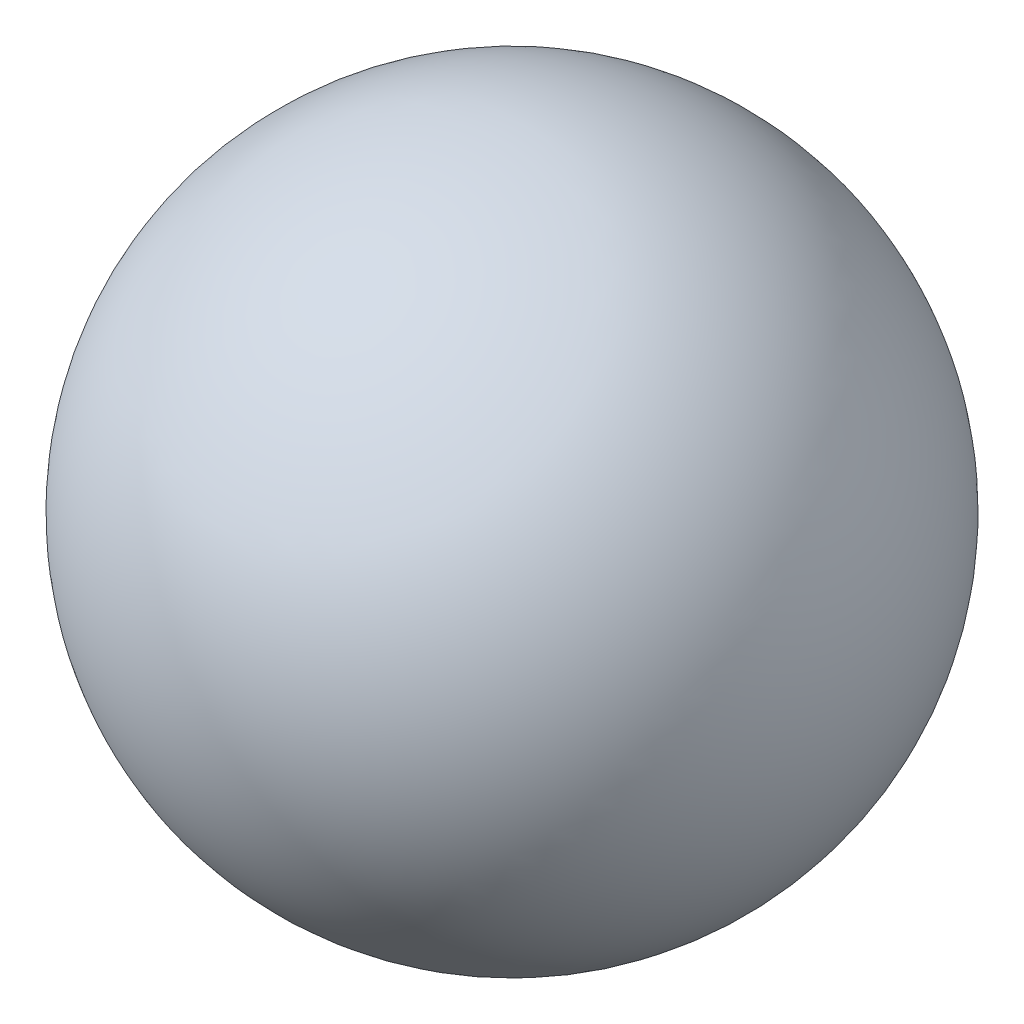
from build123d import *


with BuildPart() as part:
    # Sketch 1 → Revolve 1 (revolve)
    with BuildSketch(Plane(origin=(0, 0, 0), x_dir=(1, 0, 0), z_dir=(0, 1, 0))):
        with BuildLine():
            Line((0, 2), (0, -2))
            ThreePointArc((0, -2), (2, 0), (0, 2))
        make_face()
    revolve(axis=Axis((0, 0, 0), (0, 0, -1)))


solid = part.part
